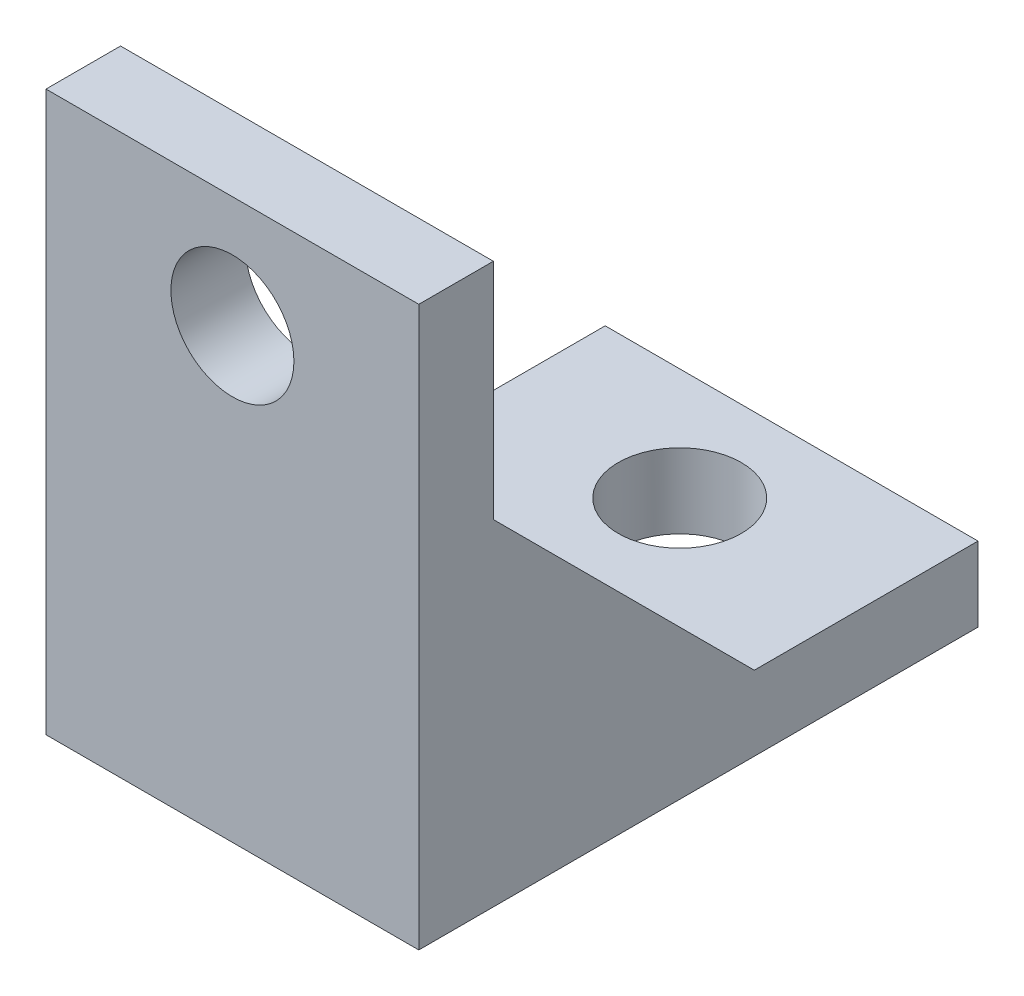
from build123d import *

# Parameters (mm, degrees)
SALIENTE_EXTRUIR1_DEPTH    = 10
CORTAR_EXTRUIR1_DEPTH      = 24.452078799
CORTAR_EXTRUIR1_DEPTH_BACK = 24.452078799
CROQUIS2_R                 = 1.65
CROQUIS3_R                 = 1.65
CORTAR_EXTRUIR2_DEPTH      = 24.452078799
NERVIO1_REACH              = 25.452
CROQUIS4_WALL_W            = 58.803652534
CROQUIS4_WALL_H            = 10


with BuildPart() as part:
    # Croquis1 → Saliente-Extruir1 (new body)
    with BuildSketch(Plane(origin=(0, 0, 0), x_dir=(0, 0, -1), z_dir=(1, 0, 0))):
        Polygon((0, 0), (0, 15), (2, 15), (2, 2), (15, 2), (15, 0), align=None)
    extrude(amount=SALIENTE_EXTRUIR1_DEPTH)

    # Croquis2 → Cortar-Extruir1 (cut, two sides: drawn at the far end of the back side and taken through both)
    with BuildSketch(Plane(origin=(0, 0, 0), x_dir=(1, 0, 0), z_dir=(0, 1, 0)).offset(-CORTAR_EXTRUIR1_DEPTH_BACK)):
        with Locations(Location((5, 12, 0), (0, 0, 90))):
            Circle(CROQUIS2_R)
    extrude(amount=CORTAR_EXTRUIR1_DEPTH + CORTAR_EXTRUIR1_DEPTH_BACK, mode=Mode.SUBTRACT)

    # Croquis3 → Cortar-Extruir2 (cut, through all)
    with BuildSketch(Plane.XY):
        with Locations((5, 12)):
            Circle(CROQUIS3_R)
    extrude(amount=-CORTAR_EXTRUIR2_DEPTH, mode=Mode.SUBTRACT)

    # Croquis4 wall → Nervio1 (add, up to next)
    with BuildSketch(Plane(origin=(0, 5.5, -5.5), x_dir=(0, -0.707106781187, -0.707106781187), z_dir=(0, 0.707106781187, -0.707106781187)), mode=Mode.PRIVATE) as nervio1_sk1:
        with Locations((0, -5)):
            Rectangle(CROQUIS4_WALL_W, CROQUIS4_WALL_H)
    nervio1_tool1 = extrude(nervio1_sk1.sketch, amount=-NERVIO1_REACH, mode=Mode.PRIVATE) - part.part
    add(nervio1_tool1.solids().sort_by_distance((0, 5.5, -5.5))[0])


solid = part.part
